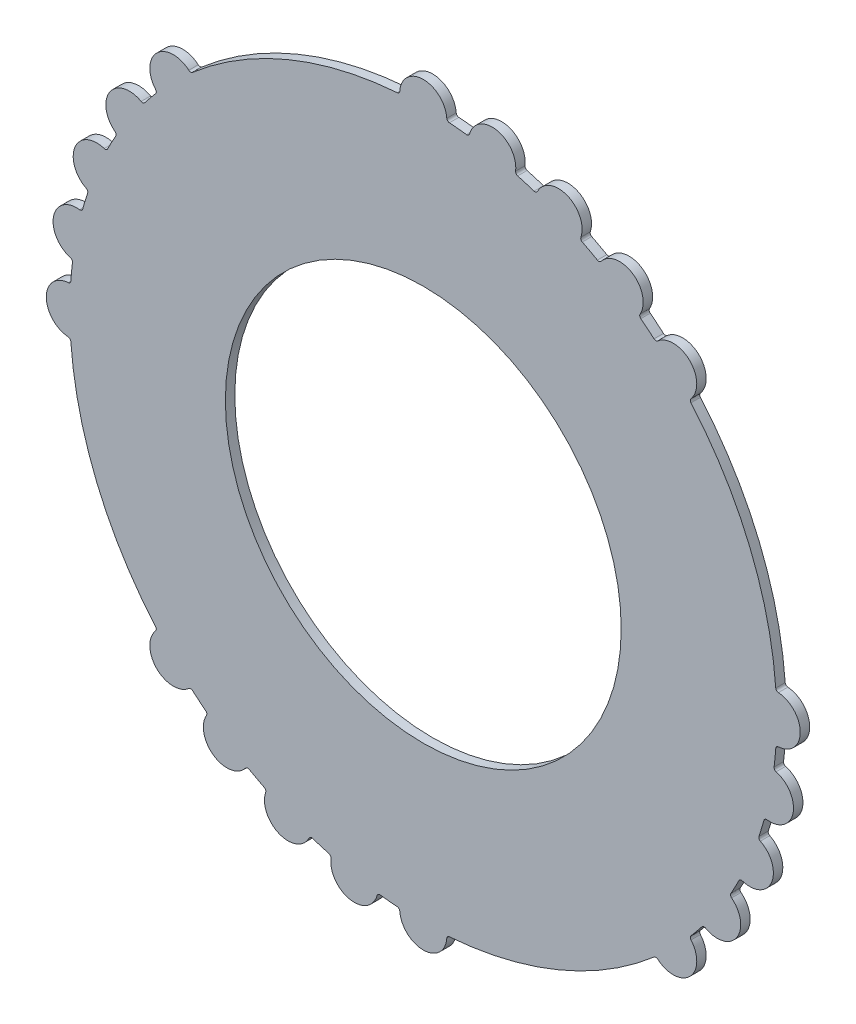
from build123d import *

# Parameters (mm, degrees)
ESQUISSE1_R      = 21
EXTRUSION1_DEPTH = 0.5


with BuildPart() as part:
    # Esquisse1 → Extrusion1 (new, symmetric)
    with BuildSketch(Plane.XY):
        with BuildLine():
            ThreePointArc((-2.770917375, 37.397486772), (-14.350628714, 34.645482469), (-24.48468203, 28.403350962))
            ThreePointArc((-24.48468203, 28.403350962), (-24.68110887, 28.330578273), (-24.877267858, 28.404069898))
            ThreePointArc((-24.877267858, 28.404069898), (-28.284271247, 28.284271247), (-28.404069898, 24.877267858))
            ThreePointArc((-28.404069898, 24.877267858), (-28.330578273, 24.68110887), (-28.403350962, 24.48468203))
            ThreePointArc((-28.403350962, 24.48468203), (-28.987892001, 23.789748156), (-29.555434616, 23.080864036))
            ThreePointArc((-29.555434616, 23.080864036), (-29.733889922, 22.971168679), (-29.940617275, 23.004979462))
            ThreePointArc((-29.940617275, 23.004979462), (-33.258784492, 22.222809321), (-32.711607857, 18.857898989))
            ThreePointArc((-32.711607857, 18.857898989), (-32.601259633, 18.679846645), (-32.63431304, 18.472996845))
            ThreePointArc((-32.63431304, 18.472996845), (-33.072047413, 17.677377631), (-33.490388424, 16.871392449))
            ThreePointArc((-33.490388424, 16.871392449), (-33.644014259, 16.728989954), (-33.853365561, 16.721820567))
            ThreePointArc((-33.853365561, 16.721820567), (-36.9551813, 15.307337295), (-35.76205707, 12.113831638))
            ThreePointArc((-35.76205707, 12.113831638), (-35.619092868, 11.96072839), (-35.611156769, 11.75140475))
            ThreePointArc((-35.611156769, 11.75140475), (-35.88526259, 10.885675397), (-36.138325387, 10.013562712))
            ThreePointArc((-36.138325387, 10.013562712), (-36.261217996, 9.843925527), (-36.465147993, 9.796051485))
            ThreePointArc((-36.465147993, 9.796051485), (-39.231411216, 7.803612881), (-37.438190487, 4.90423653))
            ThreePointArc((-37.438190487, 4.90423653), (-37.268104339, 4.78196605), (-37.219483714, 4.578212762))
            ThreePointArc((-37.219483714, 4.578212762), (-37.31942725, 3.675642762), (-37.397486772, 2.770917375))
            ThreePointArc((-37.397486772, 2.770917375), (-37.484923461, 2.580564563), (-37.675595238, 2.493825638))
            ThreePointArc((-37.675595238, 2.493825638), (-40, 0), (-37.675595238, -2.493825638))
            ThreePointArc((-37.675595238, -2.493825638), (-37.484923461, -2.580564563), (-37.397486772, -2.770917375))
            ThreePointArc((-37.397486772, -2.770917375), (-34.645482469, -14.350628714), (-28.403350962, -24.48468203))
            ThreePointArc((-28.403350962, -24.48468203), (-28.330578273, -24.68110887), (-28.404069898, -24.877267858))
            ThreePointArc((-28.404069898, -24.877267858), (-28.284271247, -28.284271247), (-24.877267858, -28.404069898))
            ThreePointArc((-24.877267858, -28.404069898), (-24.68110887, -28.330578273), (-24.48468203, -28.403350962))
            ThreePointArc((-24.48468203, -28.403350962), (-23.789748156, -28.987892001), (-23.080864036, -29.555434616))
            ThreePointArc((-23.080864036, -29.555434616), (-22.971168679, -29.733889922), (-23.004979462, -29.940617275))
            ThreePointArc((-23.004979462, -29.940617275), (-22.222809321, -33.258784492), (-18.857898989, -32.711607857))
            ThreePointArc((-18.857898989, -32.711607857), (-18.679846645, -32.601259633), (-18.472996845, -32.63431304))
            ThreePointArc((-18.472996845, -32.63431304), (-17.677377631, -33.072047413), (-16.871392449, -33.490388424))
            ThreePointArc((-16.871392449, -33.490388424), (-16.728989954, -33.644014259), (-16.721820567, -33.853365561))
            ThreePointArc((-16.721820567, -33.853365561), (-15.307337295, -36.9551813), (-12.113831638, -35.76205707))
            ThreePointArc((-12.113831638, -35.76205707), (-11.96072839, -35.619092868), (-11.75140475, -35.611156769))
            ThreePointArc((-11.75140475, -35.611156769), (-10.885675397, -35.88526259), (-10.013562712, -36.138325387))
            ThreePointArc((-10.013562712, -36.138325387), (-9.843925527, -36.261217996), (-9.796051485, -36.465147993))
            ThreePointArc((-9.796051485, -36.465147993), (-7.803612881, -39.231411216), (-4.90423653, -37.438190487))
            ThreePointArc((-4.90423653, -37.438190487), (-4.78196605, -37.268104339), (-4.578212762, -37.219483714))
            ThreePointArc((-4.578212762, -37.219483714), (-3.675642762, -37.31942725), (-2.770917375, -37.397486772))
            ThreePointArc((-2.770917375, -37.397486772), (-2.580564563, -37.484923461), (-2.493825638, -37.675595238))
            ThreePointArc((-2.493825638, -37.675595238), (0, -40), (2.493825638, -37.675595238))
            ThreePointArc((2.493825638, -37.675595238), (2.580564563, -37.484923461), (2.770917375, -37.397486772))
            ThreePointArc((2.770917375, -37.397486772), (14.350628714, -34.645482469), (24.48468203, -28.403350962))
            ThreePointArc((24.48468203, -28.403350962), (24.68110887, -28.330578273), (24.877267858, -28.404069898))
            ThreePointArc((24.877267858, -28.404069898), (28.284271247, -28.284271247), (28.404069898, -24.877267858))
            ThreePointArc((28.404069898, -24.877267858), (28.330578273, -24.68110887), (28.403350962, -24.48468203))
            ThreePointArc((28.403350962, -24.48468203), (28.987892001, -23.789748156), (29.555434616, -23.080864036))
            ThreePointArc((29.555434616, -23.080864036), (29.733889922, -22.971168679), (29.940617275, -23.004979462))
            ThreePointArc((29.940617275, -23.004979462), (33.258784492, -22.222809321), (32.711607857, -18.857898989))
            ThreePointArc((32.711607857, -18.857898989), (32.601259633, -18.679846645), (32.63431304, -18.472996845))
            ThreePointArc((32.63431304, -18.472996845), (33.072047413, -17.677377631), (33.490388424, -16.871392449))
            ThreePointArc((33.490388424, -16.871392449), (33.644014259, -16.728989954), (33.853365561, -16.721820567))
            ThreePointArc((33.853365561, -16.721820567), (36.9551813, -15.307337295), (35.76205707, -12.113831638))
            ThreePointArc((35.76205707, -12.113831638), (35.619092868, -11.96072839), (35.611156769, -11.75140475))
            ThreePointArc((35.611156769, -11.75140475), (35.88526259, -10.885675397), (36.138325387, -10.013562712))
            ThreePointArc((36.138325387, -10.013562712), (36.261217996, -9.843925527), (36.465147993, -9.796051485))
            ThreePointArc((36.465147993, -9.796051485), (39.231411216, -7.803612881), (37.438190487, -4.90423653))
            ThreePointArc((37.438190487, -4.90423653), (37.268104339, -4.78196605), (37.219483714, -4.578212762))
            ThreePointArc((37.219483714, -4.578212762), (37.31942725, -3.675642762), (37.397486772, -2.770917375))
            ThreePointArc((37.397486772, -2.770917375), (37.484923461, -2.580564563), (37.675595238, -2.493825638))
            ThreePointArc((37.675595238, -2.493825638), (40, 0), (37.675595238, 2.493825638))
            ThreePointArc((37.675595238, 2.493825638), (37.484923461, 2.580564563), (37.397486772, 2.770917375))
            ThreePointArc((37.397486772, 2.770917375), (34.645482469, 14.350628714), (28.403350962, 24.48468203))
            ThreePointArc((28.403350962, 24.48468203), (28.330578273, 24.68110887), (28.404069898, 24.877267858))
            ThreePointArc((28.404069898, 24.877267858), (28.284271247, 28.284271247), (24.877267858, 28.404069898))
            ThreePointArc((24.877267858, 28.404069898), (24.68110887, 28.330578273), (24.48468203, 28.403350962))
            ThreePointArc((24.48468203, 28.403350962), (23.789748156, 28.987892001), (23.080864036, 29.555434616))
            ThreePointArc((23.080864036, 29.555434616), (22.971168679, 29.733889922), (23.004979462, 29.940617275))
            ThreePointArc((23.004979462, 29.940617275), (22.222809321, 33.258784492), (18.857898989, 32.711607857))
            ThreePointArc((18.857898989, 32.711607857), (18.679846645, 32.601259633), (18.472996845, 32.63431304))
            ThreePointArc((18.472996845, 32.63431304), (17.677377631, 33.072047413), (16.871392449, 33.490388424))
            ThreePointArc((16.871392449, 33.490388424), (16.728989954, 33.644014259), (16.721820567, 33.853365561))
            ThreePointArc((16.721820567, 33.853365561), (15.307337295, 36.9551813), (12.113831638, 35.76205707))
            ThreePointArc((12.113831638, 35.76205707), (11.96072839, 35.619092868), (11.75140475, 35.611156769))
            ThreePointArc((11.75140475, 35.611156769), (10.885675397, 35.88526259), (10.013562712, 36.138325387))
            ThreePointArc((10.013562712, 36.138325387), (9.843925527, 36.261217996), (9.796051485, 36.465147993))
            ThreePointArc((9.796051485, 36.465147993), (7.803612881, 39.231411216), (4.90423653, 37.438190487))
            ThreePointArc((4.90423653, 37.438190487), (4.78196605, 37.268104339), (4.578212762, 37.219483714))
            ThreePointArc((4.578212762, 37.219483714), (3.675642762, 37.31942725), (2.770917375, 37.397486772))
            ThreePointArc((2.770917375, 37.397486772), (2.580564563, 37.484923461), (2.493825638, 37.675595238))
            ThreePointArc((2.493825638, 37.675595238), (0, 40), (-2.493825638, 37.675595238))
            ThreePointArc((-2.493825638, 37.675595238), (-2.580564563, 37.484923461), (-2.770917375, 37.397486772))
        make_face()
        Circle(ESQUISSE1_R, mode=Mode.SUBTRACT)
    extrude(amount=EXTRUSION1_DEPTH, both=True)


solid = part.part
